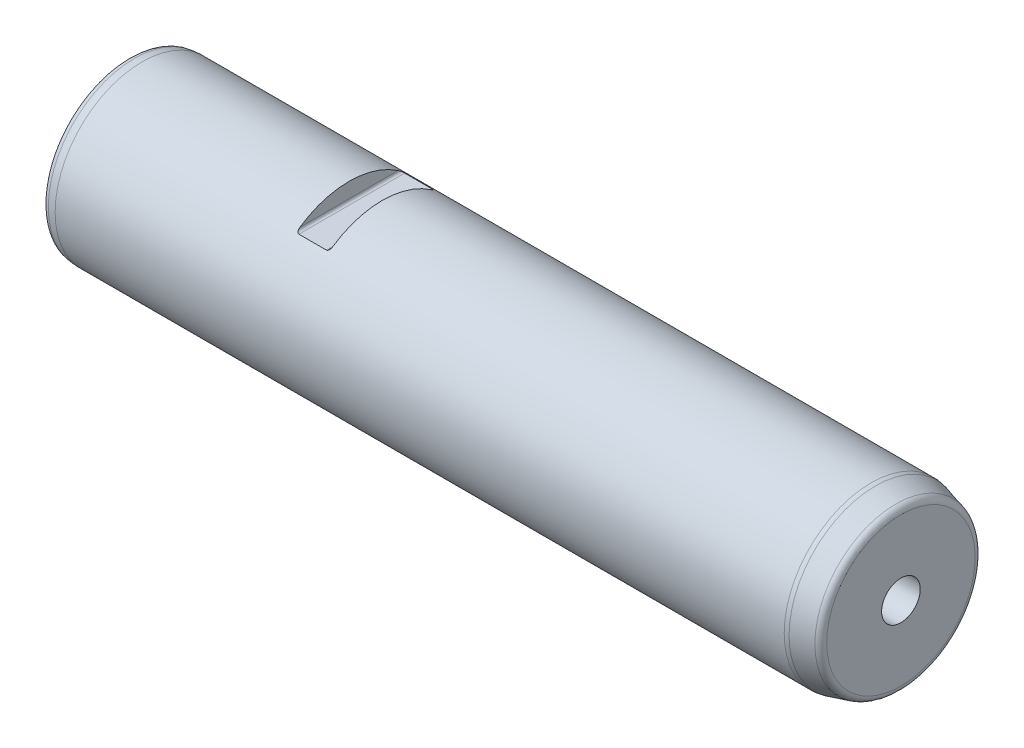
ISO-10303-21;
HEADER;
FILE_DESCRIPTION(('STEP AP214'),'2;1');
FILE_NAME('part.step','',(''),(''),'','','');
FILE_SCHEMA(('AUTOMOTIVE_DESIGN { 1 0 10303 214 1 1 1 1 }'));
ENDSEC;
DATA;
#1=APPLICATION_CONTEXT('core data for automotive mechanical design processes');
#2=APPLICATION_PROTOCOL_DEFINITION('international standard','automotive_design',2000,#1);
#3=PRODUCT_CONTEXT('',#1,'mechanical');
#4=PRODUCT('Part','Part','',(#3));
#5=PRODUCT_RELATED_PRODUCT_CATEGORY('part','',(#4));
#6=PRODUCT_DEFINITION_FORMATION('','',#4);
#7=PRODUCT_DEFINITION_CONTEXT('part definition',#1,'design');
#8=PRODUCT_DEFINITION('design','',#6,#7);
#9=PRODUCT_DEFINITION_SHAPE('','',#8);
#10=(LENGTH_UNIT() NAMED_UNIT(*) SI_UNIT(.MILLI.,.METRE.));
#11=(NAMED_UNIT(*) PLANE_ANGLE_UNIT() SI_UNIT($,.RADIAN.));
#12=(NAMED_UNIT(*) SI_UNIT($,.STERADIAN.) SOLID_ANGLE_UNIT());
#13=UNCERTAINTY_MEASURE_WITH_UNIT(LENGTH_MEASURE(1.E-05),#10,'distance_accuracy_value','');
#14=(GEOMETRIC_REPRESENTATION_CONTEXT(3) GLOBAL_UNCERTAINTY_ASSIGNED_CONTEXT((#13)) GLOBAL_UNIT_ASSIGNED_CONTEXT((#10,
#11,#12)) REPRESENTATION_CONTEXT('',''));
#15=CARTESIAN_POINT('',(0.,0.,0.));
#16=DIRECTION('',(0.,0.,1.));
#17=DIRECTION('',(1.,0.,0.));
#18=AXIS2_PLACEMENT_3D('',#15,#16,#17);
#19=CARTESIAN_POINT('',(0.,0.,0.));
#20=DIRECTION('',(1.,0.,0.));
#21=DIRECTION('',(0.,0.,-1.));
#22=AXIS2_PLACEMENT_3D('',#19,#20,#21);
#23=PLANE('',#22);
#24=CARTESIAN_POINT('',(0.,0.,0.));
#25=DIRECTION('',(1.,0.,0.));
#26=DIRECTION('',(0.,0.,-1.));
#27=AXIS2_PLACEMENT_3D('',#24,#25,#26);
#28=CIRCLE('',#27,28.7717287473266);
#29=CARTESIAN_POINT('',(0.,0.,-28.7717287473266));
#30=VERTEX_POINT('',#29);
#31=EDGE_CURVE('E160',#30,#30,#28,.F.);
#32=ORIENTED_EDGE('',*,*,#31,.T.);
#33=EDGE_LOOP('',(#32));
#34=FACE_BOUND('',#33,.T.);
#35=ADVANCED_FACE('F15',(#34),#23,.F.);
#36=CARTESIAN_POINT('',(0.,0.,0.));
#37=DIRECTION('',(-1.,0.,0.));
#38=DIRECTION('',(0.,0.,1.));
#39=AXIS2_PLACEMENT_3D('',#36,#37,#38);
#40=CYLINDRICAL_SURFACE('',#39,31.5);
#41=CARTESIAN_POINT('',(91.,25.,-19.1637678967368));
#42=CARTESIAN_POINT('',(91.0206021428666,24.9999962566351,-19.1637724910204));
#43=CARTESIAN_POINT('',(91.0411895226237,25.000637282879,-19.1629365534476));
#44=CARTESIAN_POINT('',(91.0821323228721,25.0031684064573,-19.1596340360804));
#45=CARTESIAN_POINT('',(91.1024879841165,25.0050570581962,-19.1571693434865));
#46=CARTESIAN_POINT('',(91.1624864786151,25.0124756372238,-19.1474836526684));
#47=CARTESIAN_POINT('',(91.2015690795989,25.0197603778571,-19.1379682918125));
#48=CARTESIAN_POINT('',(91.2768030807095,25.0382921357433,-19.1137163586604));
#49=CARTESIAN_POINT('',(91.3129662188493,25.0495222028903,-19.0990021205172));
#50=CARTESIAN_POINT('',(91.3821411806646,25.0751576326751,-19.0653329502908));
#51=CARTESIAN_POINT('',(91.4151429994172,25.0895726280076,-19.0463651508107));
#52=CARTESIAN_POINT('',(91.4940924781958,25.1289598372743,-18.9943915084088));
#53=CARTESIAN_POINT('',(91.537816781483,25.1555174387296,-18.9592231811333));
#54=CARTESIAN_POINT('',(91.6178752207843,25.2121909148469,-18.8837940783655));
#55=CARTESIAN_POINT('',(91.6541945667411,25.2423137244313,-18.8435233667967));
#56=CARTESIAN_POINT('',(91.7400427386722,25.323512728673,-18.7343708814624));
#57=CARTESIAN_POINT('',(91.7844613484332,25.3763362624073,-18.6627946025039));
#58=CARTESIAN_POINT('',(91.8595737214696,25.4847393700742,-18.5144966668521));
#59=CARTESIAN_POINT('',(91.8902090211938,25.5403295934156,-18.4377546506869));
#60=CARTESIAN_POINT('',(91.9297784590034,25.6300581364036,-18.3126586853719));
#61=CARTESIAN_POINT('',(91.9424916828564,25.6638849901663,-18.2652250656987));
#62=CARTESIAN_POINT('',(91.963993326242,25.7317021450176,-18.1695608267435));
#63=CARTESIAN_POINT('',(91.9727802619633,25.7656925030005,-18.121329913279));
#64=CARTESIAN_POINT('',(91.9865826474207,25.8331875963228,-18.0249779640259));
#65=CARTESIAN_POINT('',(91.9916469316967,25.8666927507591,-17.9768640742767));
#66=CARTESIAN_POINT('',(91.9983485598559,25.9335124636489,-17.8803351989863));
#67=CARTESIAN_POINT('',(91.9999892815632,25.9668271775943,-17.8319205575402));
#68=CARTESIAN_POINT('',(92.,26.,-17.7834192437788));
#69=B_SPLINE_CURVE_WITH_KNOTS('',3,(#41,#42,#43,#44,#45,#46,#47,#48,#49,#50,#51,#52,#53,#54,#55,
#56,#57,#58,#59,#60,#61,#62,#63,#64,#65,#66,#67,#68),.UNSPECIFIED.,.F.,.F.,(4,2,2,2,2,2,2,2,2,2,
2,2,2,4),(0.,0.0617521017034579,0.123432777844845,0.245296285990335,0.366642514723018,
0.488360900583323,0.673551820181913,0.859109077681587,1.15576169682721,1.45366100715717,
1.63242917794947,1.8112648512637,1.98771047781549,2.16398193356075),.UNSPECIFIED.);
#70=CARTESIAN_POINT('',(91.,25.,-19.1637678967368));
#71=VERTEX_POINT('',#70);
#72=CARTESIAN_POINT('',(92.,26.,-17.7834192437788));
#73=VERTEX_POINT('',#72);
#74=EDGE_CURVE('E206',#71,#73,#69,.T.);
#75=ORIENTED_EDGE('',*,*,#74,.T.);
#76=CARTESIAN_POINT('',(92.,0.,0.));
#77=DIRECTION('',(1.,0.,0.));
#78=DIRECTION('',(0.,0.,-1.));
#79=AXIS2_PLACEMENT_3D('',#76,#77,#78);
#80=CIRCLE('',#79,31.5);
#81=CARTESIAN_POINT('',(92.,26.,17.7834192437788));
#82=VERTEX_POINT('',#81);
#83=EDGE_CURVE('E9',#73,#82,#80,.T.);
#84=ORIENTED_EDGE('',*,*,#83,.T.);
#85=CARTESIAN_POINT('',(92.,26.,17.7834192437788));
#86=CARTESIAN_POINT('',(91.9999572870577,25.9536837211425,17.8511416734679));
#87=CARTESIAN_POINT('',(91.9967773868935,25.9070697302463,17.9187190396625));
#88=CARTESIAN_POINT('',(91.98359435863,25.8134163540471,18.0533717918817));
#89=CARTESIAN_POINT('',(91.9735592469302,25.7663759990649,18.1204433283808));
#90=CARTESIAN_POINT('',(91.9459716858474,25.672018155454,18.2538828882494));
#91=CARTESIAN_POINT('',(91.9283458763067,25.6247025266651,18.3202373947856));
#92=CARTESIAN_POINT('',(91.8846961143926,25.5309760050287,18.450628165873));
#93=CARTESIAN_POINT('',(91.8586908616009,25.4845633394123,18.5146692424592));
#94=CARTESIAN_POINT('',(91.8035708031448,25.4032208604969,18.6260588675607));
#95=CARTESIAN_POINT('',(91.7762945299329,25.3679487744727,18.6740601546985));
#96=CARTESIAN_POINT('',(91.7149053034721,25.2992635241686,18.7670081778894));
#97=CARTESIAN_POINT('',(91.6807928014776,25.2658502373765,18.8119551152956));
#98=CARTESIAN_POINT('',(91.6042482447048,25.2016125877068,18.8979268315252));
#99=CARTESIAN_POINT('',(91.5617053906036,25.1708315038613,18.9388871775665));
#100=CARTESIAN_POINT('',(91.4677411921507,25.1144557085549,19.0135816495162));
#101=CARTESIAN_POINT('',(91.4163575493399,25.0888399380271,19.0473451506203));
#102=CARTESIAN_POINT('',(91.3286773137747,25.0549354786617,19.0918997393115));
#103=CARTESIAN_POINT('',(91.2952896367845,25.0439158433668,19.106347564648));
#104=CARTESIAN_POINT('',(91.2260723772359,25.0252341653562,19.1308099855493));
#105=CARTESIAN_POINT('',(91.1902489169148,25.0175640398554,19.1408352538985));
#106=CARTESIAN_POINT('',(91.1285741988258,25.0079765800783,19.1533587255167));
#107=CARTESIAN_POINT('',(91.1031595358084,25.0050065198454,19.1572353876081));
#108=CARTESIAN_POINT('',(91.0518392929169,25.001008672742,19.1624520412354));
#109=CARTESIAN_POINT('',(91.0259323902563,24.9999872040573,19.1637837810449));
#110=CARTESIAN_POINT('',(91.,25.,19.1637678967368));
#111=B_SPLINE_CURVE_WITH_KNOTS('',3,(#85,#86,#87,#88,#89,#90,#91,#92,#93,#94,#95,#96,#97,#98,
#99,#100,#101,#102,#103,#104,#105,#106,#107,#108,#109,#110),.UNSPECIFIED.,.F.,.F.,(4,2,2,2,2,2,
2,2,2,2,2,2,4),(0.,0.246152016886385,0.493460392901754,0.743214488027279,0.992415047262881,
1.18859975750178,1.38477152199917,1.58371665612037,1.78183351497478,1.89547599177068,
2.00884269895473,2.08629068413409,2.16398936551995),.UNSPECIFIED.);
#112=CARTESIAN_POINT('',(91.,25.,19.1637678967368));
#113=VERTEX_POINT('',#112);
#114=EDGE_CURVE('E23',#82,#113,#111,.T.);
#115=ORIENTED_EDGE('',*,*,#114,.T.);
#116=DIRECTION('',(-1.,0.,0.));
#117=VECTOR('',#116,1.);
#118=CARTESIAN_POINT('',(0.,25.,19.1637678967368));
#119=LINE('',#118,#117);
#120=CARTESIAN_POINT('',(81.,25.,19.1637678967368));
#121=VERTEX_POINT('',#120);
#122=EDGE_CURVE('E74',#113,#121,#119,.T.);
#123=ORIENTED_EDGE('',*,*,#122,.T.);
#124=CARTESIAN_POINT('',(81.,25.,19.1637678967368));
#125=CARTESIAN_POINT('',(80.9793978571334,24.9999962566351,19.1637724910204));
#126=CARTESIAN_POINT('',(80.9588104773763,25.000637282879,19.1629365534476));
#127=CARTESIAN_POINT('',(80.9178676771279,25.0031684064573,19.1596340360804));
#128=CARTESIAN_POINT('',(80.8975120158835,25.0050570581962,19.1571693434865));
#129=CARTESIAN_POINT('',(80.8375135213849,25.0124756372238,19.1474836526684));
#130=CARTESIAN_POINT('',(80.7984309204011,25.0197603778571,19.1379682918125));
#131=CARTESIAN_POINT('',(80.7231969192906,25.0382921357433,19.1137163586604));
#132=CARTESIAN_POINT('',(80.6870337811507,25.0495222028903,19.0990021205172));
#133=CARTESIAN_POINT('',(80.6178588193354,25.0751576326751,19.0653329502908));
#134=CARTESIAN_POINT('',(80.5848570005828,25.0895726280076,19.0463651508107));
#135=CARTESIAN_POINT('',(80.5059075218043,25.1289598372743,18.9943915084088));
#136=CARTESIAN_POINT('',(80.4621832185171,25.1555174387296,18.9592231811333));
#137=CARTESIAN_POINT('',(80.3821247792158,25.2121909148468,18.8837940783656));
#138=CARTESIAN_POINT('',(80.345805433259,25.2423137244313,18.8435233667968));
#139=CARTESIAN_POINT('',(80.2599572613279,25.3235127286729,18.7343708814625));
#140=CARTESIAN_POINT('',(80.2155386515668,25.3763362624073,18.662794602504));
#141=CARTESIAN_POINT('',(80.1404262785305,25.4847393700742,18.5144966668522));
#142=CARTESIAN_POINT('',(80.1097909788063,25.5403295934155,18.437754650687));
#143=CARTESIAN_POINT('',(80.0702215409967,25.6300581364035,18.3126586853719));
#144=CARTESIAN_POINT('',(80.0575083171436,25.6638849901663,18.2652250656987));
#145=CARTESIAN_POINT('',(80.0360066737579,25.7317021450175,18.1695608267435));
#146=CARTESIAN_POINT('',(80.0272197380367,25.7656925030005,18.121329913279));
#147=CARTESIAN_POINT('',(80.0134173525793,25.8331875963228,18.0249779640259));
#148=CARTESIAN_POINT('',(80.0083530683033,25.866692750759,17.9768640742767));
#149=CARTESIAN_POINT('',(80.0016514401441,25.9335124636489,17.8803351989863));
#150=CARTESIAN_POINT('',(80.0000107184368,25.9668271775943,17.8319205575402));
#151=CARTESIAN_POINT('',(80.,26.,17.7834192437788));
#152=B_SPLINE_CURVE_WITH_KNOTS('',3,(#124,#125,#126,#127,#128,#129,#130,#131,#132,#133,#134,
#135,#136,#137,#138,#139,#140,#141,#142,#143,#144,#145,#146,#147,#148,#149,#150,#151),
.UNSPECIFIED.,.F.,.F.,(4,2,2,2,2,2,2,2,2,2,2,2,2,4),(0.,0.061752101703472,0.123432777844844,
0.245296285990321,0.366642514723,0.488360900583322,0.673551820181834,0.859109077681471,
1.15576169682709,1.45366100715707,1.6324291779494,1.81126485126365,1.98771047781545,
2.16398193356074),.UNSPECIFIED.);
#153=CARTESIAN_POINT('',(80.,26.,17.7834192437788));
#154=VERTEX_POINT('',#153);
#155=EDGE_CURVE('E65',#121,#154,#152,.T.);
#156=ORIENTED_EDGE('',*,*,#155,.T.);
#157=CARTESIAN_POINT('',(80.,0.,0.));
#158=DIRECTION('',(-1.,0.,0.));
#159=DIRECTION('',(0.,-1.,0.));
#160=AXIS2_PLACEMENT_3D('',#157,#158,#159);
#161=CIRCLE('',#160,31.5);
#162=CARTESIAN_POINT('',(80.,26.,-17.7834192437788));
#163=VERTEX_POINT('',#162);
#164=EDGE_CURVE('E54',#154,#163,#161,.T.);
#165=ORIENTED_EDGE('',*,*,#164,.T.);
#166=CARTESIAN_POINT('',(80.,26.,-17.7834192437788));
#167=CARTESIAN_POINT('',(80.0000427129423,25.9536837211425,-17.8511416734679));
#168=CARTESIAN_POINT('',(80.0032226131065,25.9070697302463,-17.9187190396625));
#169=CARTESIAN_POINT('',(80.01640564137,25.8134163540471,-18.0533717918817));
#170=CARTESIAN_POINT('',(80.0264407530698,25.7663759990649,-18.1204433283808));
#171=CARTESIAN_POINT('',(80.0540283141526,25.672018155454,-18.2538828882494));
#172=CARTESIAN_POINT('',(80.0716541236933,25.6247025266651,-18.3202373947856));
#173=CARTESIAN_POINT('',(80.1153038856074,25.5309760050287,-18.450628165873));
#174=CARTESIAN_POINT('',(80.1413091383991,25.4845633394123,-18.5146692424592));
#175=CARTESIAN_POINT('',(80.1964291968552,25.4032208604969,-18.6260588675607));
#176=CARTESIAN_POINT('',(80.2237054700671,25.3679487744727,-18.6740601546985));
#177=CARTESIAN_POINT('',(80.2850946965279,25.2992635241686,-18.7670081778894));
#178=CARTESIAN_POINT('',(80.3192071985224,25.2658502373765,-18.8119551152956));
#179=CARTESIAN_POINT('',(80.3957517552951,25.2016125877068,-18.8979268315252));
#180=CARTESIAN_POINT('',(80.4382946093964,25.1708315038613,-18.9388871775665));
#181=CARTESIAN_POINT('',(80.5322588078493,25.1144557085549,-19.0135816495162));
#182=CARTESIAN_POINT('',(80.5836424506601,25.0888399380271,-19.0473451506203));
#183=CARTESIAN_POINT('',(80.6713226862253,25.0549354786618,-19.0918997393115));
#184=CARTESIAN_POINT('',(80.7047103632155,25.0439158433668,-19.106347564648));
#185=CARTESIAN_POINT('',(80.7739276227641,25.0252341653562,-19.1308099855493));
#186=CARTESIAN_POINT('',(80.8097510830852,25.0175640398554,-19.1408352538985));
#187=CARTESIAN_POINT('',(80.8714258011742,25.0079765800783,-19.1533587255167));
#188=CARTESIAN_POINT('',(80.8968404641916,25.0050065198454,-19.1572353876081));
#189=CARTESIAN_POINT('',(80.9481607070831,25.001008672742,-19.1624520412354));
#190=CARTESIAN_POINT('',(80.9740676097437,24.9999872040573,-19.1637837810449));
#191=CARTESIAN_POINT('',(81.,25.,-19.1637678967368));
#192=B_SPLINE_CURVE_WITH_KNOTS('',3,(#166,#167,#168,#169,#170,#171,#172,#173,#174,#175,#176,
#177,#178,#179,#180,#181,#182,#183,#184,#185,#186,#187,#188,#189,#190,#191),.UNSPECIFIED.,.F.,
.F.,(4,2,2,2,2,2,2,2,2,2,2,2,4),(0.,0.246152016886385,0.493460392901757,0.743214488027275,
0.992415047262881,1.18859975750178,1.38477152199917,1.58371665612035,1.78183351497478,
1.89547599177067,2.00884269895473,2.08629068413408,2.16398936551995),.UNSPECIFIED.);
#193=CARTESIAN_POINT('',(81.,25.,-19.1637678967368));
#194=VERTEX_POINT('',#193);
#195=EDGE_CURVE('E59',#163,#194,#192,.T.);
#196=ORIENTED_EDGE('',*,*,#195,.T.);
#197=DIRECTION('',(-1.,0.,0.));
#198=VECTOR('',#197,1.);
#199=CARTESIAN_POINT('',(0.,25.,-19.1637678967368));
#200=LINE('',#199,#198);
#201=EDGE_CURVE('E75',#194,#71,#200,.F.);
#202=ORIENTED_EDGE('',*,*,#201,.T.);
#203=EDGE_LOOP('',(#75,#84,#115,#123,#156,#165,#196,#202));
#204=FACE_BOUND('',#203,.T.);
#205=CARTESIAN_POINT('',(5.00000000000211,0.,0.));
#206=DIRECTION('',(1.,0.,0.));
#207=DIRECTION('',(0.,0.,-1.));
#208=AXIS2_PLACEMENT_3D('',#205,#206,#207);
#209=CIRCLE('',#208,31.5);
#210=CARTESIAN_POINT('',(5.00000000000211,0.,-31.5));
#211=VERTEX_POINT('',#210);
#212=EDGE_CURVE('E159',#211,#211,#209,.T.);
#213=ORIENTED_EDGE('',*,*,#212,.T.);
#214=EDGE_LOOP('',(#213));
#215=FACE_BOUND('',#214,.T.);
#216=CARTESIAN_POINT('',(269.210085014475,0.,0.));
#217=DIRECTION('',(1.,0.,0.));
#218=DIRECTION('',(0.,0.,-1.));
#219=AXIS2_PLACEMENT_3D('',#216,#217,#218);
#220=CIRCLE('',#219,31.5);
#221=CARTESIAN_POINT('',(269.210085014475,0.,-31.5));
#222=VERTEX_POINT('',#221);
#223=EDGE_CURVE('E177',#222,#222,#220,.F.);
#224=ORIENTED_EDGE('',*,*,#223,.T.);
#225=EDGE_LOOP('',(#224));
#226=FACE_BOUND('',#225,.T.);
#227=ADVANCED_FACE('F71',(#204,#215,#226),#40,.T.);
#228=CARTESIAN_POINT('',(280.,0.,0.));
#229=DIRECTION('',(-1.,0.,0.));
#230=DIRECTION('',(0.,0.,1.));
#231=AXIS2_PLACEMENT_3D('',#228,#229,#230);
#232=CONICAL_SURFACE('',#231,28.8205080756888,0.261799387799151);
#233=CARTESIAN_POINT('',(278.147047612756,0.,0.));
#234=DIRECTION('',(1.,0.,0.));
#235=DIRECTION('',(0.,0.,-1.));
#236=AXIS2_PLACEMENT_3D('',#233,#234,#235);
#237=CIRCLE('',#236,29.317005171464);
#238=CARTESIAN_POINT('',(278.147047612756,0.,-29.317005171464));
#239=VERTEX_POINT('',#238);
#240=EDGE_CURVE('E165',#239,#239,#237,.F.);
#241=ORIENTED_EDGE('',*,*,#240,.T.);
#242=EDGE_LOOP('',(#241));
#243=FACE_BOUND('',#242,.T.);
#244=CARTESIAN_POINT('',(270.762999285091,0.,0.));
#245=DIRECTION('',(1.,0.,0.));
#246=DIRECTION('',(0.,0.,-1.));
#247=AXIS2_PLACEMENT_3D('',#244,#245,#246);
#248=CIRCLE('',#247,31.2955549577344);
#249=CARTESIAN_POINT('',(270.762999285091,0.,-31.2955549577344));
#250=VERTEX_POINT('',#249);
#251=EDGE_CURVE('E190',#250,#250,#248,.T.);
#252=ORIENTED_EDGE('',*,*,#251,.T.);
#253=EDGE_LOOP('',(#252));
#254=FACE_BOUND('',#253,.T.);
#255=ADVANCED_FACE('F122',(#243,#254),#232,.T.);
#256=CARTESIAN_POINT('',(280.,28.8205080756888,0.));
#257=DIRECTION('',(-1.,0.,0.));
#258=DIRECTION('',(0.,0.,1.));
#259=AXIS2_PLACEMENT_3D('',#256,#257,#258);
#260=PLANE('',#259);
#261=CARTESIAN_POINT('',(280.,0.,0.));
#262=DIRECTION('',(1.,0.,0.));
#263=DIRECTION('',(0.,0.,-1.));
#264=AXIS2_PLACEMENT_3D('',#261,#262,#263);
#265=CIRCLE('',#264,7.);
#266=CARTESIAN_POINT('',(280.,0.,-7.));
#267=VERTEX_POINT('',#266);
#268=EDGE_CURVE('E180',#267,#267,#265,.T.);
#269=ORIENTED_EDGE('',*,*,#268,.F.);
#270=EDGE_LOOP('',(#269));
#271=FACE_BOUND('',#270,.T.);
#272=CARTESIAN_POINT('',(280.,0.,0.));
#273=DIRECTION('',(-1.,0.,0.));
#274=DIRECTION('',(0.,0.,1.));
#275=AXIS2_PLACEMENT_3D('',#272,#273,#274);
#276=CIRCLE('',#275,26.9021906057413);
#277=CARTESIAN_POINT('',(280.,0.,26.9021906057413));
#278=VERTEX_POINT('',#277);
#279=EDGE_CURVE('E161',#278,#278,#276,.F.);
#280=ORIENTED_EDGE('',*,*,#279,.T.);
#281=EDGE_LOOP('',(#280));
#282=FACE_BOUND('',#281,.T.);
#283=ADVANCED_FACE('F119',(#271,#282),#260,.F.);
#284=CARTESIAN_POINT('',(269.210085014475,0.,0.));
#285=DIRECTION('',(1.,0.,0.));
#286=DIRECTION('',(0.,0.,-1.));
#287=AXIS2_PLACEMENT_3D('',#284,#285,#286);
#288=TOROIDAL_SURFACE('',#287,25.5,6.);
#289=ORIENTED_EDGE('',*,*,#251,.F.);
#290=EDGE_LOOP('',(#289));
#291=FACE_BOUND('',#290,.T.);
#292=ORIENTED_EDGE('',*,*,#223,.F.);
#293=EDGE_LOOP('',(#292));
#294=FACE_BOUND('',#293,.T.);
#295=ADVANCED_FACE('F121',(#291,#294),#288,.T.);
#296=CARTESIAN_POINT('',(277.5,0.,0.));
#297=DIRECTION('',(-1.,0.,0.));
#298=DIRECTION('',(0.,0.,1.));
#299=AXIS2_PLACEMENT_3D('',#296,#297,#298);
#300=TOROIDAL_SURFACE('',#299,26.9021906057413,2.5);
#301=ORIENTED_EDGE('',*,*,#279,.F.);
#302=EDGE_LOOP('',(#301));
#303=FACE_BOUND('',#302,.T.);
#304=ORIENTED_EDGE('',*,*,#240,.F.);
#305=EDGE_LOOP('',(#304));
#306=FACE_BOUND('',#305,.T.);
#307=ADVANCED_FACE('F142',(#303,#306),#300,.T.);
#308=CARTESIAN_POINT('',(0.,0.,0.));
#309=DIRECTION('',(1.,0.,0.));
#310=DIRECTION('',(0.,0.,-1.));
#311=AXIS2_PLACEMENT_3D('',#308,#309,#310);
#312=CONICAL_SURFACE('',#311,31.0625566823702,0.0872664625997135);
#313=CARTESIAN_POINT('',(2.28211064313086,0.,0.));
#314=DIRECTION('',(1.,0.,0.));
#315=DIRECTION('',(0.,0.,-1.));
#316=AXIS2_PLACEMENT_3D('',#313,#314,#315);
#317=CIRCLE('',#316,31.262215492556);
#318=CARTESIAN_POINT('',(2.28211064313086,0.,-31.262215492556));
#319=VERTEX_POINT('',#318);
#320=EDGE_CURVE('E60',#319,#319,#317,.T.);
#321=ORIENTED_EDGE('',*,*,#320,.T.);
#322=EDGE_LOOP('',(#321));
#323=FACE_BOUND('',#322,.T.);
#324=ORIENTED_EDGE('',*,*,#212,.F.);
#325=EDGE_LOOP('',(#324));
#326=FACE_BOUND('',#325,.T.);
#327=ADVANCED_FACE('F145',(#323,#326),#312,.T.);
#328=CARTESIAN_POINT('',(2.5,0.,0.));
#329=DIRECTION('',(1.,0.,0.));
#330=DIRECTION('',(0.,0.,-1.));
#331=AXIS2_PLACEMENT_3D('',#328,#329,#330);
#332=TOROIDAL_SURFACE('',#331,28.7717287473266,2.5);
#333=ORIENTED_EDGE('',*,*,#320,.F.);
#334=EDGE_LOOP('',(#333));
#335=FACE_BOUND('',#334,.T.);
#336=ORIENTED_EDGE('',*,*,#31,.F.);
#337=EDGE_LOOP('',(#336));
#338=FACE_BOUND('',#337,.T.);
#339=ADVANCED_FACE('F17',(#335,#338),#332,.T.);
#340=CARTESIAN_POINT('',(256.,0.,0.));
#341=DIRECTION('',(1.,0.,0.));
#342=DIRECTION('',(0.,0.,-1.));
#343=AXIS2_PLACEMENT_3D('',#340,#341,#342);
#344=PLANE('',#343);
#345=CARTESIAN_POINT('',(256.,0.,0.));
#346=DIRECTION('',(1.,0.,0.));
#347=DIRECTION('',(0.,0.,-1.));
#348=AXIS2_PLACEMENT_3D('',#345,#346,#347);
#349=CIRCLE('',#348,7.);
#350=CARTESIAN_POINT('',(256.,0.,-7.));
#351=VERTEX_POINT('',#350);
#352=EDGE_CURVE('E173',#351,#351,#349,.T.);
#353=ORIENTED_EDGE('',*,*,#352,.T.);
#354=EDGE_LOOP('',(#353));
#355=FACE_BOUND('',#354,.T.);
#356=CARTESIAN_POINT('',(256.,0.,0.));
#357=DIRECTION('',(1.,0.,0.));
#358=DIRECTION('',(0.,0.,-1.));
#359=AXIS2_PLACEMENT_3D('',#356,#357,#358);
#360=CIRCLE('',#359,5.1);
#361=CARTESIAN_POINT('',(256.,0.,-5.1));
#362=VERTEX_POINT('',#361);
#363=EDGE_CURVE('E170',#362,#362,#360,.F.);
#364=ORIENTED_EDGE('',*,*,#363,.T.);
#365=EDGE_LOOP('',(#364));
#366=FACE_BOUND('',#365,.T.);
#367=ADVANCED_FACE('F103',(#355,#366),#344,.T.);
#368=CARTESIAN_POINT('',(256.,0.,0.));
#369=DIRECTION('',(1.,0.,0.));
#370=DIRECTION('',(0.,0.,-1.));
#371=AXIS2_PLACEMENT_3D('',#368,#369,#370);
#372=CYLINDRICAL_SURFACE('',#371,7.);
#373=ORIENTED_EDGE('',*,*,#352,.F.);
#374=EDGE_LOOP('',(#373));
#375=FACE_BOUND('',#374,.T.);
#376=ORIENTED_EDGE('',*,*,#268,.T.);
#377=EDGE_LOOP('',(#376));
#378=FACE_BOUND('',#377,.T.);
#379=ADVANCED_FACE('F106',(#375,#378),#372,.F.);
#380=CARTESIAN_POINT('',(250.,0.,0.));
#381=DIRECTION('',(1.,0.,0.));
#382=DIRECTION('',(0.,0.,-1.));
#383=AXIS2_PLACEMENT_3D('',#380,#381,#382);
#384=CONICAL_SURFACE('',#383,5.1,1.0471975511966);
#385=CARTESIAN_POINT('',(247.055513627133,0.,0.));
#386=VERTEX_POINT('',#385);
#387=VERTEX_LOOP('',#386);
#388=FACE_BOUND('',#387,.T.);
#389=CARTESIAN_POINT('',(250.,0.,0.));
#390=DIRECTION('',(1.,0.,0.));
#391=DIRECTION('',(0.,0.,-1.));
#392=AXIS2_PLACEMENT_3D('',#389,#390,#391);
#393=CIRCLE('',#392,5.1);
#394=CARTESIAN_POINT('',(250.,0.,-5.1));
#395=VERTEX_POINT('',#394);
#396=EDGE_CURVE('E172',#395,#395,#393,.T.);
#397=ORIENTED_EDGE('',*,*,#396,.T.);
#398=EDGE_LOOP('',(#397));
#399=FACE_BOUND('',#398,.T.);
#400=ADVANCED_FACE('F110',(#388,#399),#384,.F.);
#401=CARTESIAN_POINT('',(280.,0.,0.));
#402=DIRECTION('',(1.,0.,0.));
#403=DIRECTION('',(0.,0.,-1.));
#404=AXIS2_PLACEMENT_3D('',#401,#402,#403);
#405=CYLINDRICAL_SURFACE('',#404,5.1);
#406=ORIENTED_EDGE('',*,*,#396,.F.);
#407=EDGE_LOOP('',(#406));
#408=FACE_BOUND('',#407,.T.);
#409=ORIENTED_EDGE('',*,*,#363,.F.);
#410=EDGE_LOOP('',(#409));
#411=FACE_BOUND('',#410,.T.);
#412=ADVANCED_FACE('F112',(#408,#411),#405,.F.);
#413=CARTESIAN_POINT('',(92.,26.,-31.5));
#414=DIRECTION('',(1.,0.,0.));
#415=DIRECTION('',(0.,0.,-1.));
#416=AXIS2_PLACEMENT_3D('',#413,#414,#415);
#417=PLANE('',#416);
#418=DIRECTION('',(0.,0.,1.));
#419=VECTOR('',#418,1.);
#420=CARTESIAN_POINT('',(92.,26.,-31.5));
#421=LINE('',#420,#419);
#422=EDGE_CURVE('E184',#73,#82,#421,.T.);
#423=ORIENTED_EDGE('',*,*,#422,.T.);
#424=ORIENTED_EDGE('',*,*,#83,.F.);
#425=EDGE_LOOP('',(#423,#424));
#426=FACE_BOUND('',#425,.T.);
#427=ADVANCED_FACE('F115',(#426),#417,.F.);
#428=CARTESIAN_POINT('',(91.,26.,-31.5));
#429=DIRECTION('',(0.,0.,1.));
#430=DIRECTION('',(1.,0.,0.));
#431=AXIS2_PLACEMENT_3D('',#428,#429,#430);
#432=CYLINDRICAL_SURFACE('',#431,1.);
#433=ORIENTED_EDGE('',*,*,#422,.F.);
#434=ORIENTED_EDGE('',*,*,#74,.F.);
#435=DIRECTION('',(0.,0.,1.));
#436=VECTOR('',#435,1.);
#437=CARTESIAN_POINT('',(91.,25.,-31.5));
#438=LINE('',#437,#436);
#439=EDGE_CURVE('E199',#71,#113,#438,.T.);
#440=ORIENTED_EDGE('',*,*,#439,.T.);
#441=ORIENTED_EDGE('',*,*,#114,.F.);
#442=EDGE_LOOP('',(#433,#434,#440,#441));
#443=FACE_BOUND('',#442,.T.);
#444=ADVANCED_FACE('F217',(#443),#432,.F.);
#445=CARTESIAN_POINT('',(81.,25.,-31.5));
#446=DIRECTION('',(0.,-1.,0.));
#447=DIRECTION('',(0.,0.,-1.));
#448=AXIS2_PLACEMENT_3D('',#445,#446,#447);
#449=PLANE('',#448);
#450=ORIENTED_EDGE('',*,*,#439,.F.);
#451=ORIENTED_EDGE('',*,*,#201,.F.);
#452=DIRECTION('',(0.,0.,1.));
#453=VECTOR('',#452,1.);
#454=CARTESIAN_POINT('',(81.,25.,-31.5));
#455=LINE('',#454,#453);
#456=EDGE_CURVE('E67',#194,#121,#455,.T.);
#457=ORIENTED_EDGE('',*,*,#456,.T.);
#458=ORIENTED_EDGE('',*,*,#122,.F.);
#459=EDGE_LOOP('',(#450,#451,#457,#458));
#460=FACE_BOUND('',#459,.T.);
#461=ADVANCED_FACE('F98',(#460),#449,.F.);
#462=CARTESIAN_POINT('',(81.,26.,-31.5));
#463=DIRECTION('',(0.,0.,1.));
#464=DIRECTION('',(1.,0.,0.));
#465=AXIS2_PLACEMENT_3D('',#462,#463,#464);
#466=CYLINDRICAL_SURFACE('',#465,1.);
#467=ORIENTED_EDGE('',*,*,#456,.F.);
#468=ORIENTED_EDGE('',*,*,#195,.F.);
#469=DIRECTION('',(0.,0.,1.));
#470=VECTOR('',#469,1.);
#471=CARTESIAN_POINT('',(80.,26.,-31.5));
#472=LINE('',#471,#470);
#473=EDGE_CURVE('E29',#163,#154,#472,.T.);
#474=ORIENTED_EDGE('',*,*,#473,.T.);
#475=ORIENTED_EDGE('',*,*,#155,.F.);
#476=EDGE_LOOP('',(#467,#468,#474,#475));
#477=FACE_BOUND('',#476,.T.);
#478=ADVANCED_FACE('F64',(#477),#466,.F.);
#479=CARTESIAN_POINT('',(80.,31.5,-31.5));
#480=DIRECTION('',(-1.,0.,0.));
#481=DIRECTION('',(0.,-1.,0.));
#482=AXIS2_PLACEMENT_3D('',#479,#480,#481);
#483=PLANE('',#482);
#484=ORIENTED_EDGE('',*,*,#473,.F.);
#485=ORIENTED_EDGE('',*,*,#164,.F.);
#486=EDGE_LOOP('',(#484,#485));
#487=FACE_BOUND('',#486,.T.);
#488=ADVANCED_FACE('F55',(#487),#483,.F.);
#489=CLOSED_SHELL('',(#35,#227,#255,#283,#295,#307,#327,#339,#367,#379,#400,#412,#427,#444,#461,
#478,#488));
#490=MANIFOLD_SOLID_BREP('B1',#489);
#491=ADVANCED_BREP_SHAPE_REPRESENTATION('',(#18,#490),#14);
#492=SHAPE_DEFINITION_REPRESENTATION(#9,#491);
ENDSEC;
END-ISO-10303-21;
